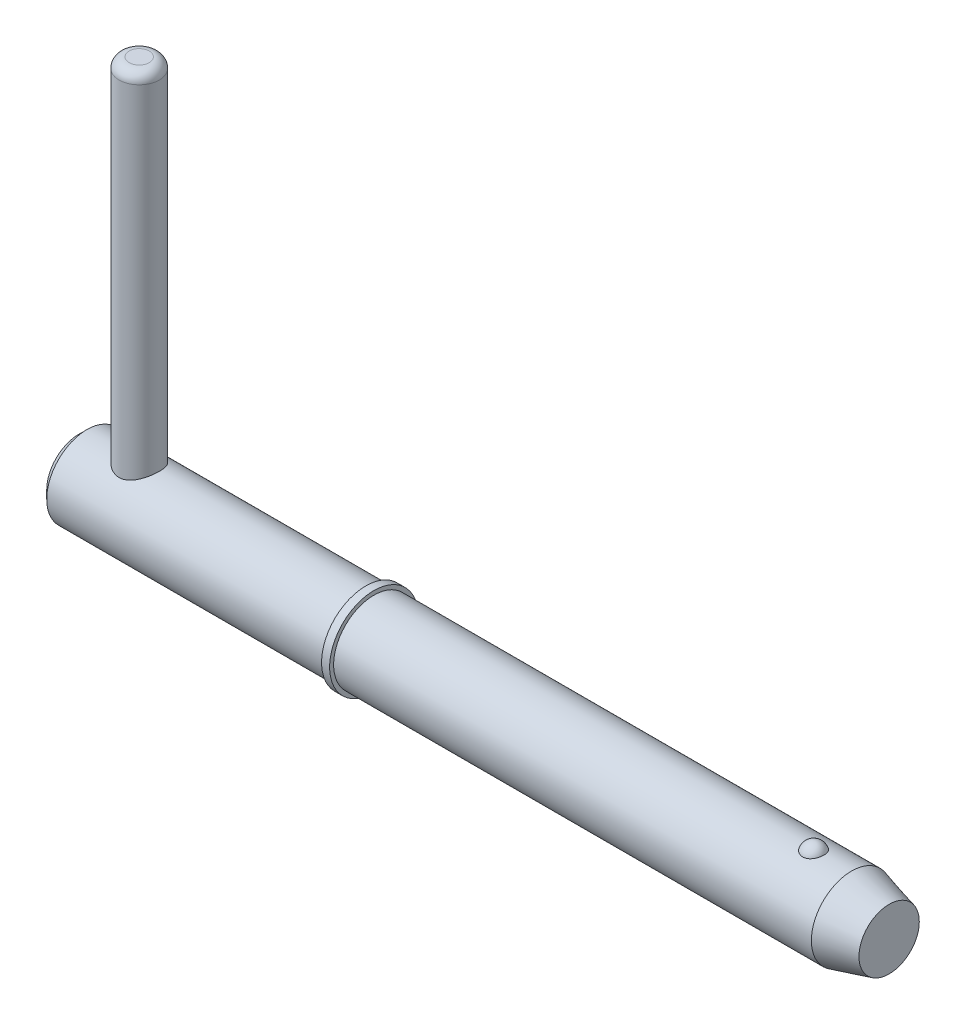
ISO-10303-21;
HEADER;
FILE_DESCRIPTION(('STEP AP214'),'2;1');
FILE_NAME('part.step','',(''),(''),'','','');
FILE_SCHEMA(('AUTOMOTIVE_DESIGN { 1 0 10303 214 1 1 1 1 }'));
ENDSEC;
DATA;
#1=APPLICATION_CONTEXT('core data for automotive mechanical design processes');
#2=APPLICATION_PROTOCOL_DEFINITION('international standard','automotive_design',2000,#1);
#3=PRODUCT_CONTEXT('',#1,'mechanical');
#4=PRODUCT('Part','Part','',(#3));
#5=PRODUCT_RELATED_PRODUCT_CATEGORY('part','',(#4));
#6=PRODUCT_DEFINITION_FORMATION('','',#4);
#7=PRODUCT_DEFINITION_CONTEXT('part definition',#1,'design');
#8=PRODUCT_DEFINITION('design','',#6,#7);
#9=PRODUCT_DEFINITION_SHAPE('','',#8);
#10=(LENGTH_UNIT() NAMED_UNIT(*) SI_UNIT(.MILLI.,.METRE.));
#11=(NAMED_UNIT(*) PLANE_ANGLE_UNIT() SI_UNIT($,.RADIAN.));
#12=(NAMED_UNIT(*) SI_UNIT($,.STERADIAN.) SOLID_ANGLE_UNIT());
#13=UNCERTAINTY_MEASURE_WITH_UNIT(LENGTH_MEASURE(1.E-05),#10,'distance_accuracy_value','');
#14=(GEOMETRIC_REPRESENTATION_CONTEXT(3) GLOBAL_UNCERTAINTY_ASSIGNED_CONTEXT((#13)) GLOBAL_UNIT_ASSIGNED_CONTEXT((#10,
#11,#12)) REPRESENTATION_CONTEXT('',''));
#15=CARTESIAN_POINT('',(0.,0.,0.));
#16=DIRECTION('',(0.,0.,1.));
#17=DIRECTION('',(1.,0.,0.));
#18=AXIS2_PLACEMENT_3D('',#15,#16,#17);
#19=CARTESIAN_POINT('',(3.57,23.02,0.));
#20=DIRECTION('',(0.,-1.,0.));
#21=DIRECTION('',(0.,0.,-1.));
#22=AXIS2_PLACEMENT_3D('',#19,#20,#21);
#23=CYLINDRICAL_SURFACE('',#22,1.19);
#24=CARTESIAN_POINT('',(3.57,-1.785,0.));
#25=DIRECTION('',(0.,1.,0.));
#26=DIRECTION('',(0.,0.,1.));
#27=AXIS2_PLACEMENT_3D('',#24,#25,#26);
#28=CIRCLE('',#27,1.19);
#29=CARTESIAN_POINT('',(3.57,-1.785,1.19));
#30=VERTEX_POINT('',#29);
#31=EDGE_CURVE('P0_E25',#30,#30,#28,.T.);
#32=ORIENTED_EDGE('',*,*,#31,.T.);
#33=EDGE_LOOP('',(#32));
#34=FACE_BOUND('',#33,.T.);
#35=CARTESIAN_POINT('',(3.57,22.425,0.));
#36=DIRECTION('',(0.,1.,0.));
#37=DIRECTION('',(0.,0.,1.));
#38=AXIS2_PLACEMENT_3D('',#35,#36,#37);
#39=CIRCLE('',#38,1.19);
#40=CARTESIAN_POINT('',(3.57,22.425,1.19));
#41=VERTEX_POINT('',#40);
#42=EDGE_CURVE('P0_E29',#41,#41,#39,.F.);
#43=ORIENTED_EDGE('',*,*,#42,.T.);
#44=EDGE_LOOP('',(#43));
#45=FACE_BOUND('',#44,.T.);
#46=ADVANCED_FACE('P0_F14',(#34,#45),#23,.T.);
#47=CARTESIAN_POINT('',(3.57,23.02,0.));
#48=DIRECTION('',(0.,1.,0.));
#49=DIRECTION('',(0.,0.,1.));
#50=AXIS2_PLACEMENT_3D('',#47,#48,#49);
#51=PLANE('',#50);
#52=CARTESIAN_POINT('',(3.57,23.02,0.));
#53=DIRECTION('',(0.,1.,0.));
#54=DIRECTION('',(0.,0.,1.));
#55=AXIS2_PLACEMENT_3D('',#52,#53,#54);
#56=CIRCLE('',#55,0.595);
#57=CARTESIAN_POINT('',(3.57,23.02,0.595));
#58=VERTEX_POINT('',#57);
#59=EDGE_CURVE('P0_E10',#58,#58,#56,.T.);
#60=ORIENTED_EDGE('',*,*,#59,.T.);
#61=EDGE_LOOP('',(#60));
#62=FACE_BOUND('',#61,.T.);
#63=ADVANCED_FACE('P0_F46',(#62),#51,.T.);
#64=CARTESIAN_POINT('',(3.57,-2.38,0.));
#65=DIRECTION('',(0.,1.,0.));
#66=DIRECTION('',(0.,0.,1.));
#67=AXIS2_PLACEMENT_3D('',#64,#65,#66);
#68=PLANE('',#67);
#69=CARTESIAN_POINT('',(3.57,-2.38,0.));
#70=DIRECTION('',(0.,1.,0.));
#71=DIRECTION('',(0.,0.,1.));
#72=AXIS2_PLACEMENT_3D('',#69,#70,#71);
#73=CIRCLE('',#72,0.595);
#74=CARTESIAN_POINT('',(3.57,-2.38,0.595));
#75=VERTEX_POINT('',#74);
#76=EDGE_CURVE('P0_E21',#75,#75,#73,.F.);
#77=ORIENTED_EDGE('',*,*,#76,.T.);
#78=EDGE_LOOP('',(#77));
#79=FACE_BOUND('',#78,.T.);
#80=ADVANCED_FACE('P0_F43',(#79),#68,.F.);
#81=CARTESIAN_POINT('',(3.57,-1.785,0.));
#82=DIRECTION('',(0.,1.,0.));
#83=DIRECTION('',(0.,0.,1.));
#84=AXIS2_PLACEMENT_3D('',#81,#82,#83);
#85=DEGENERATE_TOROIDAL_SURFACE('',#84,0.595,0.595,.T.);
#86=ORIENTED_EDGE('',*,*,#76,.F.);
#87=EDGE_LOOP('',(#86));
#88=FACE_BOUND('',#87,.T.);
#89=ORIENTED_EDGE('',*,*,#31,.F.);
#90=EDGE_LOOP('',(#89));
#91=FACE_BOUND('',#90,.T.);
#92=ADVANCED_FACE('P0_F38',(#88,#91),#85,.T.);
#93=CARTESIAN_POINT('',(3.57,22.425,0.));
#94=DIRECTION('',(0.,1.,0.));
#95=DIRECTION('',(0.,0.,1.));
#96=AXIS2_PLACEMENT_3D('',#93,#94,#95);
#97=DEGENERATE_TOROIDAL_SURFACE('',#96,0.595,0.595,.T.);
#98=ORIENTED_EDGE('',*,*,#42,.F.);
#99=EDGE_LOOP('',(#98));
#100=FACE_BOUND('',#99,.T.);
#101=ORIENTED_EDGE('',*,*,#59,.F.);
#102=EDGE_LOOP('',(#101));
#103=FACE_BOUND('',#102,.T.);
#104=ADVANCED_FACE('P0_F16',(#100,#103),#97,.T.);
#105=CLOSED_SHELL('',(#46,#63,#80,#92,#104));
#106=MANIFOLD_SOLID_BREP('P0_B1',#105);
#107=CARTESIAN_POINT('',(0.,0.,0.));
#108=DIRECTION('',(1.,0.,0.));
#109=DIRECTION('',(0.,0.,-1.));
#110=AXIS2_PLACEMENT_3D('',#107,#108,#109);
#111=CYLINDRICAL_SURFACE('',#110,2.38);
#112=CARTESIAN_POINT('',(45.7094297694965,0.,0.));
#113=DIRECTION('',(1.,0.,0.));
#114=DIRECTION('',(0.,0.,-1.));
#115=AXIS2_PLACEMENT_3D('',#112,#113,#114);
#116=CIRCLE('',#115,2.38);
#117=CARTESIAN_POINT('',(45.7094297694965,0.,-2.38));
#118=VERTEX_POINT('',#117);
#119=EDGE_CURVE('P1_E81',#118,#118,#116,.T.);
#120=ORIENTED_EDGE('',*,*,#119,.F.);
#121=EDGE_LOOP('',(#120));
#122=FACE_BOUND('',#121,.T.);
#123=CARTESIAN_POINT('',(17.45,0.,0.));
#124=DIRECTION('',(1.,0.,0.));
#125=DIRECTION('',(0.,0.,-1.));
#126=AXIS2_PLACEMENT_3D('',#123,#124,#125);
#127=CIRCLE('',#126,2.38);
#128=CARTESIAN_POINT('',(17.45,0.,-2.38));
#129=VERTEX_POINT('',#128);
#130=EDGE_CURVE('P1_E85',#129,#129,#127,.T.);
#131=ORIENTED_EDGE('',*,*,#130,.T.);
#132=EDGE_LOOP('',(#131));
#133=FACE_BOUND('',#132,.T.);
#134=CARTESIAN_POINT('',(43.4634492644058,2.2921568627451,0.640637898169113));
#135=CARTESIAN_POINT('',(43.4303559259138,2.29215737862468,0.640637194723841));
#136=CARTESIAN_POINT('',(43.3972546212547,2.29293179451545,0.637884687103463));
#137=CARTESIAN_POINT('',(43.3320176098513,2.29594030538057,0.626968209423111));
#138=CARTESIAN_POINT('',(43.2998823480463,2.29817506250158,0.61880178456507));
#139=CARTESIAN_POINT('',(43.2375402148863,2.3038430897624,0.597351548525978));
#140=CARTESIAN_POINT('',(43.2073305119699,2.30727454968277,0.584075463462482));
#141=CARTESIAN_POINT('',(43.1495674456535,2.31495941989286,0.552829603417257));
#142=CARTESIAN_POINT('',(43.1220141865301,2.31921286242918,0.534859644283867));
#143=CARTESIAN_POINT('',(43.0695938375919,2.32820213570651,0.494282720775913));
#144=CARTESIAN_POINT('',(43.0448050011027,2.33294694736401,0.471576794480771));
#145=CARTESIAN_POINT('',(42.9992169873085,2.34234144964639,0.422446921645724));
#146=CARTESIAN_POINT('',(42.9784185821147,2.34699112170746,0.396022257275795));
#147=CARTESIAN_POINT('',(42.9403580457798,2.35593942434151,0.338855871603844));
#148=CARTESIAN_POINT('',(42.9233051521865,2.36021170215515,0.307970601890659));
#149=CARTESIAN_POINT('',(42.8943607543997,2.3677057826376,0.243750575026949));
#150=CARTESIAN_POINT('',(42.8824701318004,2.37092740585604,0.210415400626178));
#151=CARTESIAN_POINT('',(42.8638076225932,2.37606901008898,0.1411894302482));
#152=CARTESIAN_POINT('',(42.8571956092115,2.37794816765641,0.10525240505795));
#153=CARTESIAN_POINT('',(42.8498095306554,2.38005135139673,0.032735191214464));
#154=CARTESIAN_POINT('',(42.8490358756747,2.38027526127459,-0.0038450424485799));
#155=CARTESIAN_POINT('',(42.8533628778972,2.37903842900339,-0.0769838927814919));
#156=CARTESIAN_POINT('',(42.8585202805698,2.37756141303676,-0.1135388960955));
#157=CARTESIAN_POINT('',(42.8747013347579,2.37305303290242,-0.185229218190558));
#158=CARTESIAN_POINT('',(42.8857251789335,2.37002161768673,-0.220364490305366));
#159=CARTESIAN_POINT('',(42.9133977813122,2.36273722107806,-0.28815667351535));
#160=CARTESIAN_POINT('',(42.9300389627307,2.35848588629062,-0.320816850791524));
#161=CARTESIAN_POINT('',(42.9685984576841,2.34923130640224,-0.382744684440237));
#162=CARTESIAN_POINT('',(42.990516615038,2.34422808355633,-0.412012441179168));
#163=CARTESIAN_POINT('',(43.0387549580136,2.33412555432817,-0.465830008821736));
#164=CARTESIAN_POINT('',(43.065002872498,2.32902887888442,-0.490444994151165));
#165=CARTESIAN_POINT('',(43.1214769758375,2.31926941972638,-0.534700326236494));
#166=CARTESIAN_POINT('',(43.151702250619,2.3146065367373,-0.554341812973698));
#167=CARTESIAN_POINT('',(43.2140618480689,2.30645675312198,-0.587312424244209));
#168=CARTESIAN_POINT('',(43.2460780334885,2.30293152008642,-0.600855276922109));
#169=CARTESIAN_POINT('',(43.3120795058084,2.29725171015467,-0.622220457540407));
#170=CARTESIAN_POINT('',(43.3460641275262,2.29509667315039,-0.630044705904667));
#171=CARTESIAN_POINT('',(43.413299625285,2.29249264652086,-0.639452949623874));
#172=CARTESIAN_POINT('',(43.4465087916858,2.29196755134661,-0.641315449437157));
#173=CARTESIAN_POINT('',(43.512763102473,2.29246849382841,-0.639522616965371));
#174=CARTESIAN_POINT('',(43.5458082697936,2.29349430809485,-0.635868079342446));
#175=CARTESIAN_POINT('',(43.6101025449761,2.29694059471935,-0.623301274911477));
#176=CARTESIAN_POINT('',(43.6413744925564,2.29933234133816,-0.614497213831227));
#177=CARTESIAN_POINT('',(43.7019952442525,2.30522511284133,-0.592006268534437));
#178=CARTESIAN_POINT('',(43.7313438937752,2.30872622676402,-0.578318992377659));
#179=CARTESIAN_POINT('',(43.7880369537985,2.31655795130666,-0.546112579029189));
#180=CARTESIAN_POINT('',(43.815320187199,2.32090569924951,-0.527490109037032));
#181=CARTESIAN_POINT('',(43.8664904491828,2.3299220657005,-0.486117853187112));
#182=CARTESIAN_POINT('',(43.8903767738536,2.33459075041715,-0.46336721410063));
#183=CARTESIAN_POINT('',(43.9352722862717,2.34399834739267,-0.413220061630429));
#184=CARTESIAN_POINT('',(43.9560972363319,2.34873051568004,-0.385657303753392));
#185=CARTESIAN_POINT('',(43.993056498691,2.35754932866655,-0.327455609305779));
#186=CARTESIAN_POINT('',(44.0091898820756,2.36163584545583,-0.296816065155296));
#187=CARTESIAN_POINT('',(44.0369822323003,2.36889321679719,-0.232047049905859));
#188=CARTESIAN_POINT('',(44.0484450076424,2.37202275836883,-0.197828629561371));
#189=CARTESIAN_POINT('',(44.0657523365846,2.37681926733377,-0.127900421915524));
#190=CARTESIAN_POINT('',(44.0715962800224,2.37848607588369,-0.0921904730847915));
#191=CARTESIAN_POINT('',(44.077605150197,2.38020024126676,-0.0196348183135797));
#192=CARTESIAN_POINT('',(44.0776704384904,2.38021918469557,0.0172198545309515));
#193=CARTESIAN_POINT('',(44.0718689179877,2.37856356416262,0.0904219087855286));
#194=CARTESIAN_POINT('',(44.0660018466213,2.37688892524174,0.126769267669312));
#195=CARTESIAN_POINT('',(44.048425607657,2.37201688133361,0.19802859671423));
#196=CARTESIAN_POINT('',(44.0366998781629,2.36881516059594,0.232936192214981));
#197=CARTESIAN_POINT('',(44.0076354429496,2.36123444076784,0.300196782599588));
#198=CARTESIAN_POINT('',(43.9902967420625,2.3568554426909,0.332549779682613));
#199=CARTESIAN_POINT('',(43.9505350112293,2.34744667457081,0.39349541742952));
#200=CARTESIAN_POINT('',(43.9281528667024,2.34242227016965,0.422115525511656));
#201=CARTESIAN_POINT('',(43.8787391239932,2.33227293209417,0.475004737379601));
#202=CARTESIAN_POINT('',(43.8517076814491,2.32714800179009,0.499273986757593));
#203=CARTESIAN_POINT('',(43.7944988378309,2.31755359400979,0.542046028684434));
#204=CARTESIAN_POINT('',(43.7644297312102,2.3130698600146,0.560690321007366));
#205=CARTESIAN_POINT('',(43.7013869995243,2.30514125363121,0.592447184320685));
#206=CARTESIAN_POINT('',(43.6684158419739,2.30169550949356,0.605564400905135));
#207=CARTESIAN_POINT('',(43.6068424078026,2.29677744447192,0.623927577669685));
#208=CARTESIAN_POINT('',(43.5785555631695,2.295058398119,0.630178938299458));
#209=CARTESIAN_POINT('',(43.5213308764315,2.29274795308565,0.638534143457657));
#210=CARTESIAN_POINT('',(43.4923931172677,2.29215641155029,0.640638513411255));
#211=CARTESIAN_POINT('',(43.4634492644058,2.2921568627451,0.640637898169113));
#212=B_SPLINE_CURVE_WITH_KNOTS('',3,(#134,#135,#136,#137,#138,#139,#140,#141,#142,#143,#144,
#145,#146,#147,#148,#149,#150,#151,#152,#153,#154,#155,#156,#157,#158,#159,#160,#161,#162,#163,
#164,#165,#166,#167,#168,#169,#170,#171,#172,#173,#174,#175,#176,#177,#178,#179,#180,#181,#182,
#183,#184,#185,#186,#187,#188,#189,#190,#191,#192,#193,#194,#195,#196,#197,#198,#199,#200,#201,
#202,#203,#204,#205,#206,#207,#208,#209,#210,#211),.UNSPECIFIED.,.T.,.F.,(4,2,2,2,2,2,2,2,2,2,2,
2,2,2,2,2,2,2,2,2,2,2,2,2,2,2,2,2,2,2,2,2,2,2,2,2,2,2,4),(0.,0.0991724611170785,
0.198389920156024,0.29745794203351,0.396529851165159,0.497927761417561,0.599345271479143,
0.705475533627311,0.811623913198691,0.920876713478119,1.03013718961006,1.14045177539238,
1.25076998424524,1.36093998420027,1.47110672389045,1.57959248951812,1.68805336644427,
1.79234266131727,1.89659691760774,1.99590391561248,2.09519661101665,2.19247425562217,
2.28975970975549,2.38926978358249,2.48880044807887,2.59293588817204,2.69709193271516,
2.80525821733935,2.91343624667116,3.02347917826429,3.13352698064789,3.24388765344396,
3.35424823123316,3.46374443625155,3.5732369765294,3.67968690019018,3.78604717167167,
3.87279565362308,3.9595331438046),.UNSPECIFIED.);
#213=CARTESIAN_POINT('',(43.4634492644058,2.2921568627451,0.640637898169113));
#214=VERTEX_POINT('',#213);
#215=EDGE_CURVE('P1_E35',#214,#214,#212,.T.);
#216=ORIENTED_EDGE('',*,*,#215,.T.);
#217=EDGE_LOOP('',(#216));
#218=FACE_BOUND('',#217,.T.);
#219=ADVANCED_FACE('P1_F13',(#122,#133,#218),#111,.T.);
#220=CARTESIAN_POINT('',(0.,0.,0.));
#221=DIRECTION('',(-1.,0.,0.));
#222=DIRECTION('',(0.,0.,1.));
#223=AXIS2_PLACEMENT_3D('',#220,#221,#222);
#224=PLANE('',#223);
#225=CARTESIAN_POINT('',(0.,0.,0.));
#226=DIRECTION('',(1.,0.,0.));
#227=DIRECTION('',(0.,0.,-1.));
#228=AXIS2_PLACEMENT_3D('',#225,#226,#227);
#229=CIRCLE('',#228,1.904);
#230=CARTESIAN_POINT('',(0.,0.,-1.904));
#231=VERTEX_POINT('',#230);
#232=EDGE_CURVE('P1_E9',#231,#231,#229,.T.);
#233=ORIENTED_EDGE('',*,*,#232,.F.);
#234=EDGE_LOOP('',(#233));
#235=FACE_BOUND('',#234,.T.);
#236=ADVANCED_FACE('P1_F15',(#235),#224,.T.);
#237=CARTESIAN_POINT('',(0.475999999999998,0.,0.));
#238=DIRECTION('',(1.,0.,0.));
#239=DIRECTION('',(0.,0.,-1.));
#240=AXIS2_PLACEMENT_3D('',#237,#238,#239);
#241=CONICAL_SURFACE('',#240,2.38,0.78539816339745);
#242=ORIENTED_EDGE('',*,*,#232,.T.);
#243=EDGE_LOOP('',(#242));
#244=FACE_BOUND('',#243,.T.);
#245=CARTESIAN_POINT('',(0.475999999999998,0.,0.));
#246=DIRECTION('',(1.,0.,0.));
#247=DIRECTION('',(0.,0.,-1.));
#248=AXIS2_PLACEMENT_3D('',#245,#246,#247);
#249=CIRCLE('',#248,2.38);
#250=CARTESIAN_POINT('',(0.475999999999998,0.,-2.38));
#251=VERTEX_POINT('',#250);
#252=EDGE_CURVE('P1_E26',#251,#251,#249,.T.);
#253=ORIENTED_EDGE('',*,*,#252,.F.);
#254=EDGE_LOOP('',(#253));
#255=FACE_BOUND('',#254,.T.);
#256=ADVANCED_FACE('P1_F77',(#244,#255),#241,.T.);
#257=CARTESIAN_POINT('',(0.,0.,0.));
#258=DIRECTION('',(1.,0.,0.));
#259=DIRECTION('',(0.,0.,-1.));
#260=AXIS2_PLACEMENT_3D('',#257,#258,#259);
#261=CYLINDRICAL_SURFACE('',#260,2.38);
#262=CARTESIAN_POINT('',(3.57,-2.06114046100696,1.19));
#263=CARTESIAN_POINT('',(3.50799170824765,-2.06114586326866,1.18999567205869));
#264=CARTESIAN_POINT('',(3.4459051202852,-2.0639812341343,1.18512096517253));
#265=CARTESIAN_POINT('',(3.32363755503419,-2.07491216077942,1.16587061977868));
#266=CARTESIAN_POINT('',(3.26346086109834,-2.08301876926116,1.15147501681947));
#267=CARTESIAN_POINT('',(3.14701251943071,-2.10331722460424,1.11395893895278));
#268=CARTESIAN_POINT('',(3.09072196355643,-2.1154873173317,1.09088484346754));
#269=CARTESIAN_POINT('',(2.9828251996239,-2.14250771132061,1.03680835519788));
#270=CARTESIAN_POINT('',(2.93121924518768,-2.15735815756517,1.00580553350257));
#271=CARTESIAN_POINT('',(2.82945618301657,-2.18956274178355,0.933753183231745));
#272=CARTESIAN_POINT('',(2.77976962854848,-2.20702235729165,0.892085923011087));
#273=CARTESIAN_POINT('',(2.68772401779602,-2.2416265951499,0.801172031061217));
#274=CARTESIAN_POINT('',(2.64536861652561,-2.25877105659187,0.751921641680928));
#275=CARTESIAN_POINT('',(2.56639309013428,-2.29219557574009,0.64318258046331));
#276=CARTESIAN_POINT('',(2.53035201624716,-2.30833946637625,0.583227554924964));
#277=CARTESIAN_POINT('',(2.46908238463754,-2.3365739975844,0.45714686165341));
#278=CARTESIAN_POINT('',(2.44384700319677,-2.34866719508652,0.391025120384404));
#279=CARTESIAN_POINT('',(2.40676945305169,-2.36667748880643,0.259473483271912));
#280=CARTESIAN_POINT('',(2.39410206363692,-2.37297281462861,0.194329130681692));
#281=CARTESIAN_POINT('',(2.3798023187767,-2.3800902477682,0.0625590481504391));
#282=CARTESIAN_POINT('',(2.37816328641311,-2.38091566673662,-0.00406576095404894));
#283=CARTESIAN_POINT('',(2.38564854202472,-2.37717948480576,-0.130700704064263));
#284=CARTESIAN_POINT('',(2.39384923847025,-2.37308010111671,-0.190782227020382));
#285=CARTESIAN_POINT('',(2.41912820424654,-2.360653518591,-0.308583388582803));
#286=CARTESIAN_POINT('',(2.43620713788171,-2.35232600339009,-0.366302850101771));
#287=CARTESIAN_POINT('',(2.47886825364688,-2.33206184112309,-0.478748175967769));
#288=CARTESIAN_POINT('',(2.50456481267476,-2.32007685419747,-0.533421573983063));
#289=CARTESIAN_POINT('',(2.56357346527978,-2.29357798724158,-0.637812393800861));
#290=CARTESIAN_POINT('',(2.5968882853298,-2.27906320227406,-0.687528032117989));
#291=CARTESIAN_POINT('',(2.67380546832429,-2.24724829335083,-0.785606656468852));
#292=CARTESIAN_POINT('',(2.71808260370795,-2.22981457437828,-0.833397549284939));
#293=CARTESIAN_POINT('',(2.81386177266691,-2.19500665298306,-0.921184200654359));
#294=CARTESIAN_POINT('',(2.86536931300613,-2.17763250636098,-0.961173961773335));
#295=CARTESIAN_POINT('',(2.97815134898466,-2.14371545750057,-1.03471134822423));
#296=CARTESIAN_POINT('',(3.03983836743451,-2.12729540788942,-1.06768860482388));
#297=CARTESIAN_POINT('',(3.16889582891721,-2.09886785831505,-1.12254974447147));
#298=CARTESIAN_POINT('',(3.2362602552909,-2.0868557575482,-1.14444520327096));
#299=CARTESIAN_POINT('',(3.36914526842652,-2.06994116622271,-1.1747444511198));
#300=CARTESIAN_POINT('',(3.43438893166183,-2.06455070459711,-1.18407989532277));
#301=CARTESIAN_POINT('',(3.56571759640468,-2.06010324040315,-1.1918051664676));
#302=CARTESIAN_POINT('',(3.63180197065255,-2.06104176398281,-1.19020272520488));
#303=CARTESIAN_POINT('',(3.75522816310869,-2.06862860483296,-1.17695289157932));
#304=CARTESIAN_POINT('',(3.81273554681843,-2.07464109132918,-1.16642350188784));
#305=CARTESIAN_POINT('',(3.92505766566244,-2.09075885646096,-1.1372785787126));
#306=CARTESIAN_POINT('',(3.97987152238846,-2.1008654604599,-1.1186604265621));
#307=CARTESIAN_POINT('',(4.08813948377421,-2.12458104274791,-1.07296063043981));
#308=CARTESIAN_POINT('',(4.14141303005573,-2.13833055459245,-1.04552693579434));
#309=CARTESIAN_POINT('',(4.2429084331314,-2.16765782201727,-0.983281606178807));
#310=CARTESIAN_POINT('',(4.29112767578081,-2.18323651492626,-0.948466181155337));
#311=CARTESIAN_POINT('',(4.38750473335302,-2.2168271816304,-0.867316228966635));
#312=CARTESIAN_POINT('',(4.43488860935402,-2.23489833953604,-0.82008287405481));
#313=CARTESIAN_POINT('',(4.52130056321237,-2.26973739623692,-0.718051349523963));
#314=CARTESIAN_POINT('',(4.56032581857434,-2.28650485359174,-0.663250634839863));
#315=CARTESIAN_POINT('',(4.62978273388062,-2.31742220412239,-0.545657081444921));
#316=CARTESIAN_POINT('',(4.65996041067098,-2.33149133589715,-0.482691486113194));
#317=CARTESIAN_POINT('',(4.7089941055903,-2.35481192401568,-0.351671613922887));
#318=CARTESIAN_POINT('',(4.7278600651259,-2.36406760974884,-0.283621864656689));
#319=CARTESIAN_POINT('',(4.75210859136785,-2.3760433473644,-0.151105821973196));
#320=CARTESIAN_POINT('',(4.75856947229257,-2.37928514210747,-0.0868836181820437));
#321=CARTESIAN_POINT('',(4.76100348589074,-2.38050135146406,0.0417999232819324));
#322=CARTESIAN_POINT('',(4.75698028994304,-2.37847760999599,0.106261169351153));
#323=CARTESIAN_POINT('',(4.73927447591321,-2.36969422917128,0.229120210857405));
#324=CARTESIAN_POINT('',(4.72624582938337,-2.36325544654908,0.287637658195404));
#325=CARTESIAN_POINT('',(4.69178087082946,-2.34658591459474,0.401560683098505));
#326=CARTESIAN_POINT('',(4.67034335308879,-2.33635462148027,0.456965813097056));
#327=CARTESIAN_POINT('',(4.61871480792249,-2.31247857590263,0.565753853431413));
#328=CARTESIAN_POINT('',(4.58818860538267,-2.29870654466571,0.618948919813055));
#329=CARTESIAN_POINT('',(4.51967006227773,-2.26918878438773,0.719681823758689));
#330=CARTESIAN_POINT('',(4.48167429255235,-2.25344215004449,0.76721704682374));
#331=CARTESIAN_POINT('',(4.39491140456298,-2.21969046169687,0.860267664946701));
#332=CARTESIAN_POINT('',(4.34544863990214,-2.20161660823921,0.905111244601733));
#333=CARTESIAN_POINT('',(4.23943364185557,-2.16655060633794,0.986109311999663));
#334=CARTESIAN_POINT('',(4.18287520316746,-2.1495594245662,1.02225611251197));
#335=CARTESIAN_POINT('',(4.06190239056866,-2.1181953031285,1.08579298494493));
#336=CARTESIAN_POINT('',(3.9972962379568,-2.10392207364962,1.11287022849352));
#337=CARTESIAN_POINT('',(3.86353443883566,-2.08090726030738,1.15534566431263));
#338=CARTESIAN_POINT('',(3.7943948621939,-2.07214719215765,1.17078291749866));
#339=CARTESIAN_POINT('',(3.69875162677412,-2.06499834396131,1.18329673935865));
#340=CARTESIAN_POINT('',(3.67309220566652,-2.06355673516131,1.18580656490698));
#341=CARTESIAN_POINT('',(3.62162638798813,-2.06162663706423,1.18915915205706));
#342=CARTESIAN_POINT('',(3.59581998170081,-2.0611382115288,1.19000180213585));
#343=CARTESIAN_POINT('',(3.57,-2.06114046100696,1.19));
#344=B_SPLINE_CURVE_WITH_KNOTS('',3,(#262,#263,#264,#265,#266,#267,#268,#269,#270,#271,#272,
#273,#274,#275,#276,#277,#278,#279,#280,#281,#282,#283,#284,#285,#286,#287,#288,#289,#290,#291,
#292,#293,#294,#295,#296,#297,#298,#299,#300,#301,#302,#303,#304,#305,#306,#307,#308,#309,#310,
#311,#312,#313,#314,#315,#316,#317,#318,#319,#320,#321,#322,#323,#324,#325,#326,#327,#328,#329,
#330,#331,#332,#333,#334,#335,#336,#337,#338,#339,#340,#341,#342,#343),.UNSPECIFIED.,.T.,.F.,(4,
2,2,2,2,2,2,2,2,2,2,2,2,2,2,2,2,2,2,2,2,2,2,2,2,2,2,2,2,2,2,2,2,2,2,2,2,2,2,2,4),(0.,
0.185916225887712,0.372223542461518,0.557549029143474,0.742884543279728,0.943506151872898,
1.14422749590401,1.35847891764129,1.5725948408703,1.77147547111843,1.97023568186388,
2.15171156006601,2.33320101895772,2.51720146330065,2.70126786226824,2.902733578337,
3.10435357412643,3.31877721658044,3.53297641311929,3.73020126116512,3.92728670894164,
4.1028127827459,4.27839572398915,4.46211082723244,4.64592048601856,4.8529002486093,
5.0599497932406,5.27246375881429,5.48479067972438,5.67763601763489,5.87041383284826,
6.05048865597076,6.23058930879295,6.41839293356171,6.60628297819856,6.8128718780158,
7.01964271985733,7.2329479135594,7.44553408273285,7.52294360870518,7.60035831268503),.UNSPECIFIED.);
#345=CARTESIAN_POINT('',(3.57,-2.06114046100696,1.19));
#346=VERTEX_POINT('',#345);
#347=EDGE_CURVE('P1_E17',#346,#346,#344,.T.);
#348=ORIENTED_EDGE('',*,*,#347,.F.);
#349=EDGE_LOOP('',(#348));
#350=FACE_BOUND('',#349,.T.);
#351=CARTESIAN_POINT('',(3.57,2.06114046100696,1.19));
#352=CARTESIAN_POINT('',(3.63200829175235,2.06114586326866,1.18999567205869));
#353=CARTESIAN_POINT('',(3.6940948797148,2.0639812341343,1.18512096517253));
#354=CARTESIAN_POINT('',(3.81636244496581,2.07491216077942,1.16587061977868));
#355=CARTESIAN_POINT('',(3.87653913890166,2.08301876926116,1.15147501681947));
#356=CARTESIAN_POINT('',(3.99298748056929,2.10331722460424,1.11395893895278));
#357=CARTESIAN_POINT('',(4.04927803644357,2.1154873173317,1.09088484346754));
#358=CARTESIAN_POINT('',(4.1571748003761,2.14250771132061,1.03680835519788));
#359=CARTESIAN_POINT('',(4.20878075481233,2.15735815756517,1.00580553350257));
#360=CARTESIAN_POINT('',(4.31054381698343,2.18956274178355,0.933753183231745));
#361=CARTESIAN_POINT('',(4.36023037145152,2.20702235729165,0.892085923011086));
#362=CARTESIAN_POINT('',(4.45227598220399,2.2416265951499,0.801172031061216));
#363=CARTESIAN_POINT('',(4.49463138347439,2.25877105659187,0.751921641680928));
#364=CARTESIAN_POINT('',(4.57360690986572,2.29219557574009,0.643182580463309));
#365=CARTESIAN_POINT('',(4.60964798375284,2.30833946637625,0.583227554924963));
#366=CARTESIAN_POINT('',(4.67091761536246,2.3365739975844,0.457146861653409));
#367=CARTESIAN_POINT('',(4.69615299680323,2.34866719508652,0.391025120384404));
#368=CARTESIAN_POINT('',(4.73323054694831,2.36667748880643,0.259473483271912));
#369=CARTESIAN_POINT('',(4.74589793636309,2.37297281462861,0.194329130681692));
#370=CARTESIAN_POINT('',(4.7601976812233,2.3800902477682,0.0625590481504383));
#371=CARTESIAN_POINT('',(4.76183671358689,2.38091566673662,-0.00406576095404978));
#372=CARTESIAN_POINT('',(4.75435145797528,2.37717948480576,-0.130700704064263));
#373=CARTESIAN_POINT('',(4.74615076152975,2.37308010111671,-0.190782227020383));
#374=CARTESIAN_POINT('',(4.72087179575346,2.360653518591,-0.308583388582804));
#375=CARTESIAN_POINT('',(4.70379286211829,2.35232600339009,-0.366302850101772));
#376=CARTESIAN_POINT('',(4.66113174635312,2.33206184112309,-0.478748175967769));
#377=CARTESIAN_POINT('',(4.63543518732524,2.32007685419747,-0.533421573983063));
#378=CARTESIAN_POINT('',(4.57642653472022,2.29357798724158,-0.637812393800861));
#379=CARTESIAN_POINT('',(4.5431117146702,2.27906320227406,-0.687528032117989));
#380=CARTESIAN_POINT('',(4.46619453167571,2.24724829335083,-0.785606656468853));
#381=CARTESIAN_POINT('',(4.42191739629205,2.22981457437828,-0.83339754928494));
#382=CARTESIAN_POINT('',(4.32613822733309,2.19500665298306,-0.921184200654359));
#383=CARTESIAN_POINT('',(4.27463068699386,2.17763250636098,-0.961173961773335));
#384=CARTESIAN_POINT('',(4.16184865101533,2.14371545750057,-1.03471134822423));
#385=CARTESIAN_POINT('',(4.10016163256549,2.12729540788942,-1.06768860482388));
#386=CARTESIAN_POINT('',(3.97110417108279,2.09886785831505,-1.12254974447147));
#387=CARTESIAN_POINT('',(3.9037397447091,2.0868557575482,-1.14444520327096));
#388=CARTESIAN_POINT('',(3.77085473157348,2.06994116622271,-1.1747444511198));
#389=CARTESIAN_POINT('',(3.70561106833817,2.06455070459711,-1.18407989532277));
#390=CARTESIAN_POINT('',(3.57428240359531,2.06010324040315,-1.1918051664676));
#391=CARTESIAN_POINT('',(3.50819802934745,2.06104176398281,-1.19020272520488));
#392=CARTESIAN_POINT('',(3.38477183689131,2.06862860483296,-1.17695289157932));
#393=CARTESIAN_POINT('',(3.32726445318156,2.07464109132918,-1.16642350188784));
#394=CARTESIAN_POINT('',(3.21494233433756,2.09075885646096,-1.1372785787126));
#395=CARTESIAN_POINT('',(3.16012847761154,2.1008654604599,-1.1186604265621));
#396=CARTESIAN_POINT('',(3.05186051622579,2.12458104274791,-1.07296063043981));
#397=CARTESIAN_POINT('',(2.99858696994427,2.13833055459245,-1.04552693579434));
#398=CARTESIAN_POINT('',(2.8970915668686,2.16765782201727,-0.983281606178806));
#399=CARTESIAN_POINT('',(2.84887232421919,2.18323651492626,-0.948466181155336));
#400=CARTESIAN_POINT('',(2.75249526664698,2.2168271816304,-0.867316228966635));
#401=CARTESIAN_POINT('',(2.70511139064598,2.23489833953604,-0.820082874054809));
#402=CARTESIAN_POINT('',(2.61869943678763,2.26973739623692,-0.718051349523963));
#403=CARTESIAN_POINT('',(2.57967418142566,2.28650485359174,-0.663250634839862));
#404=CARTESIAN_POINT('',(2.51021726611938,2.31742220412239,-0.54565708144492));
#405=CARTESIAN_POINT('',(2.48003958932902,2.33149133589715,-0.482691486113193));
#406=CARTESIAN_POINT('',(2.4310058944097,2.35481192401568,-0.351671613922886));
#407=CARTESIAN_POINT('',(2.4121399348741,2.36406760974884,-0.283621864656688));
#408=CARTESIAN_POINT('',(2.38789140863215,2.3760433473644,-0.151105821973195));
#409=CARTESIAN_POINT('',(2.38143052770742,2.37928514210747,-0.0868836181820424));
#410=CARTESIAN_POINT('',(2.37899651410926,2.38050135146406,0.0417999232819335));
#411=CARTESIAN_POINT('',(2.38301971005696,2.37847760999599,0.106261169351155));
#412=CARTESIAN_POINT('',(2.40072552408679,2.36969422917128,0.229120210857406));
#413=CARTESIAN_POINT('',(2.41375417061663,2.36325544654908,0.287637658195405));
#414=CARTESIAN_POINT('',(2.44821912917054,2.34658591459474,0.401560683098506));
#415=CARTESIAN_POINT('',(2.46965664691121,2.33635462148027,0.456965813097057));
#416=CARTESIAN_POINT('',(2.52128519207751,2.31247857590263,0.565753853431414));
#417=CARTESIAN_POINT('',(2.55181139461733,2.29870654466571,0.618948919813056));
#418=CARTESIAN_POINT('',(2.62032993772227,2.26918878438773,0.719681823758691));
#419=CARTESIAN_POINT('',(2.65832570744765,2.25344215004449,0.767217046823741));
#420=CARTESIAN_POINT('',(2.74508859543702,2.21969046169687,0.860267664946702));
#421=CARTESIAN_POINT('',(2.79455136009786,2.20161660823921,0.905111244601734));
#422=CARTESIAN_POINT('',(2.90056635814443,2.16655060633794,0.986109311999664));
#423=CARTESIAN_POINT('',(2.95712479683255,2.1495594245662,1.02225611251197));
#424=CARTESIAN_POINT('',(3.07809760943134,2.1181953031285,1.08579298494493));
#425=CARTESIAN_POINT('',(3.1427037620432,2.10392207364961,1.11287022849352));
#426=CARTESIAN_POINT('',(3.27646556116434,2.08090726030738,1.15534566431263));
#427=CARTESIAN_POINT('',(3.3456051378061,2.07214719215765,1.17078291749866));
#428=CARTESIAN_POINT('',(3.44124837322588,2.06499834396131,1.18329673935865));
#429=CARTESIAN_POINT('',(3.46690779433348,2.06355673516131,1.18580656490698));
#430=CARTESIAN_POINT('',(3.51837361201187,2.06162663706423,1.18915915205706));
#431=CARTESIAN_POINT('',(3.54418001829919,2.0611382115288,1.19000180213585));
#432=CARTESIAN_POINT('',(3.57,2.06114046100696,1.19));
#433=B_SPLINE_CURVE_WITH_KNOTS('',3,(#351,#352,#353,#354,#355,#356,#357,#358,#359,#360,#361,
#362,#363,#364,#365,#366,#367,#368,#369,#370,#371,#372,#373,#374,#375,#376,#377,#378,#379,#380,
#381,#382,#383,#384,#385,#386,#387,#388,#389,#390,#391,#392,#393,#394,#395,#396,#397,#398,#399,
#400,#401,#402,#403,#404,#405,#406,#407,#408,#409,#410,#411,#412,#413,#414,#415,#416,#417,#418,
#419,#420,#421,#422,#423,#424,#425,#426,#427,#428,#429,#430,#431,#432),.UNSPECIFIED.,.T.,.F.,(4,
2,2,2,2,2,2,2,2,2,2,2,2,2,2,2,2,2,2,2,2,2,2,2,2,2,2,2,2,2,2,2,2,2,2,2,2,2,2,2,4),(0.,
0.185916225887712,0.372223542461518,0.557549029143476,0.74288454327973,0.9435061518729,
1.14422749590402,1.35847891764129,1.5725948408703,1.77147547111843,1.97023568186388,
2.15171156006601,2.33320101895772,2.51720146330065,2.70126786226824,2.902733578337,
3.10435357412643,3.31877721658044,3.53297641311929,3.73020126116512,3.92728670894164,
4.1028127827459,4.27839572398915,4.46211082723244,4.64592048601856,4.8529002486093,
5.05994979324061,5.27246375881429,5.48479067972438,5.67763601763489,5.87041383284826,
6.05048865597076,6.23058930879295,6.41839293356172,6.60628297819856,6.8128718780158,
7.01964271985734,7.2329479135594,7.44553408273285,7.52294360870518,7.60035831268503),.UNSPECIFIED.);
#434=CARTESIAN_POINT('',(3.57,2.06114046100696,1.19));
#435=VERTEX_POINT('',#434);
#436=EDGE_CURVE('P1_E43',#435,#435,#433,.T.);
#437=ORIENTED_EDGE('',*,*,#436,.F.);
#438=EDGE_LOOP('',(#437));
#439=FACE_BOUND('',#438,.T.);
#440=ORIENTED_EDGE('',*,*,#252,.T.);
#441=EDGE_LOOP('',(#440));
#442=FACE_BOUND('',#441,.T.);
#443=CARTESIAN_POINT('',(16.974,0.,0.));
#444=DIRECTION('',(1.,0.,0.));
#445=DIRECTION('',(0.,0.,-1.));
#446=AXIS2_PLACEMENT_3D('',#443,#444,#445);
#447=CIRCLE('',#446,2.38);
#448=CARTESIAN_POINT('',(16.974,0.,-2.38));
#449=VERTEX_POINT('',#448);
#450=EDGE_CURVE('P1_E31',#449,#449,#447,.T.);
#451=ORIENTED_EDGE('',*,*,#450,.F.);
#452=EDGE_LOOP('',(#451));
#453=FACE_BOUND('',#452,.T.);
#454=ADVANCED_FACE('P1_F103',(#350,#439,#442,#453),#261,.T.);
#455=CARTESIAN_POINT('',(16.974,2.38,0.));
#456=DIRECTION('',(-1.,0.,0.));
#457=DIRECTION('',(0.,0.,1.));
#458=AXIS2_PLACEMENT_3D('',#455,#456,#457);
#459=PLANE('',#458);
#460=ORIENTED_EDGE('',*,*,#450,.T.);
#461=EDGE_LOOP('',(#460));
#462=FACE_BOUND('',#461,.T.);
#463=CARTESIAN_POINT('',(16.974,0.,0.));
#464=DIRECTION('',(1.,0.,0.));
#465=DIRECTION('',(0.,0.,-1.));
#466=AXIS2_PLACEMENT_3D('',#463,#464,#465);
#467=CIRCLE('',#466,2.618);
#468=CARTESIAN_POINT('',(16.974,0.,-2.618));
#469=VERTEX_POINT('',#468);
#470=EDGE_CURVE('P1_E91',#469,#469,#467,.T.);
#471=ORIENTED_EDGE('',*,*,#470,.F.);
#472=EDGE_LOOP('',(#471));
#473=FACE_BOUND('',#472,.T.);
#474=ADVANCED_FACE('P1_F100',(#462,#473),#459,.T.);
#475=CARTESIAN_POINT('',(0.,0.,0.));
#476=DIRECTION('',(1.,0.,0.));
#477=DIRECTION('',(0.,0.,-1.));
#478=AXIS2_PLACEMENT_3D('',#475,#476,#477);
#479=CYLINDRICAL_SURFACE('',#478,2.618);
#480=ORIENTED_EDGE('',*,*,#470,.T.);
#481=EDGE_LOOP('',(#480));
#482=FACE_BOUND('',#481,.T.);
#483=CARTESIAN_POINT('',(17.45,0.,0.));
#484=DIRECTION('',(1.,0.,0.));
#485=DIRECTION('',(0.,0.,-1.));
#486=AXIS2_PLACEMENT_3D('',#483,#484,#485);
#487=CIRCLE('',#486,2.618);
#488=CARTESIAN_POINT('',(17.45,0.,-2.618));
#489=VERTEX_POINT('',#488);
#490=EDGE_CURVE('P1_E88',#489,#489,#487,.T.);
#491=ORIENTED_EDGE('',*,*,#490,.F.);
#492=EDGE_LOOP('',(#491));
#493=FACE_BOUND('',#492,.T.);
#494=ADVANCED_FACE('P1_F68',(#482,#493),#479,.T.);
#495=CARTESIAN_POINT('',(17.45,2.618,0.));
#496=DIRECTION('',(1.,0.,0.));
#497=DIRECTION('',(0.,0.,-1.));
#498=AXIS2_PLACEMENT_3D('',#495,#496,#497);
#499=PLANE('',#498);
#500=ORIENTED_EDGE('',*,*,#490,.T.);
#501=EDGE_LOOP('',(#500));
#502=FACE_BOUND('',#501,.T.);
#503=ORIENTED_EDGE('',*,*,#130,.F.);
#504=EDGE_LOOP('',(#503));
#505=FACE_BOUND('',#504,.T.);
#506=ADVANCED_FACE('P1_F62',(#502,#505),#499,.T.);
#507=CARTESIAN_POINT('',(47.93,0.,0.));
#508=DIRECTION('',(-1.,0.,0.));
#509=DIRECTION('',(0.,0.,1.));
#510=AXIS2_PLACEMENT_3D('',#507,#508,#509);
#511=CONICAL_SURFACE('',#510,1.78500000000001,0.26179938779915);
#512=ORIENTED_EDGE('',*,*,#119,.T.);
#513=EDGE_LOOP('',(#512));
#514=FACE_BOUND('',#513,.T.);
#515=CARTESIAN_POINT('',(47.93,0.,0.));
#516=DIRECTION('',(1.,0.,0.));
#517=DIRECTION('',(0.,0.,-1.));
#518=AXIS2_PLACEMENT_3D('',#515,#516,#517);
#519=CIRCLE('',#518,1.78500000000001);
#520=CARTESIAN_POINT('',(47.93,0.,-1.78500000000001));
#521=VERTEX_POINT('',#520);
#522=EDGE_CURVE('P1_E42',#521,#521,#519,.T.);
#523=ORIENTED_EDGE('',*,*,#522,.F.);
#524=EDGE_LOOP('',(#523));
#525=FACE_BOUND('',#524,.T.);
#526=ADVANCED_FACE('P1_F59',(#514,#525),#511,.T.);
#527=CARTESIAN_POINT('',(47.93,1.78500000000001,0.));
#528=DIRECTION('',(1.,0.,0.));
#529=DIRECTION('',(0.,0.,-1.));
#530=AXIS2_PLACEMENT_3D('',#527,#528,#529);
#531=PLANE('',#530);
#532=ORIENTED_EDGE('',*,*,#522,.T.);
#533=EDGE_LOOP('',(#532));
#534=FACE_BOUND('',#533,.T.);
#535=ADVANCED_FACE('P1_F55',(#534),#531,.T.);
#536=CARTESIAN_POINT('',(43.4634492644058,2.142,0.));
#537=DIRECTION('',(-1.,0.,0.));
#538=DIRECTION('',(0.,1.,0.));
#539=AXIS2_PLACEMENT_3D('',#536,#537,#538);
#540=SPHERICAL_SURFACE('',#539,0.657999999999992);
#541=ORIENTED_EDGE('',*,*,#215,.F.);
#542=EDGE_LOOP('',(#541));
#543=FACE_BOUND('',#542,.T.);
#544=ADVANCED_FACE('P1_F50',(#543),#540,.T.);
#545=CARTESIAN_POINT('',(3.57,-2.618,0.));
#546=DIRECTION('',(0.,1.,0.));
#547=DIRECTION('',(0.,0.,1.));
#548=AXIS2_PLACEMENT_3D('',#545,#546,#547);
#549=CYLINDRICAL_SURFACE('',#548,1.19);
#550=ORIENTED_EDGE('',*,*,#347,.T.);
#551=EDGE_LOOP('',(#550));
#552=FACE_BOUND('',#551,.T.);
#553=ORIENTED_EDGE('',*,*,#436,.T.);
#554=EDGE_LOOP('',(#553));
#555=FACE_BOUND('',#554,.T.);
#556=ADVANCED_FACE('P1_F54',(#552,#555),#549,.F.);
#557=CLOSED_SHELL('',(#219,#236,#256,#454,#474,#494,#506,#526,#535,#544,#556));
#558=MANIFOLD_SOLID_BREP('P1_B1',#557);
#559=ADVANCED_BREP_SHAPE_REPRESENTATION('',(#18,#106,#558),#14);
#560=SHAPE_DEFINITION_REPRESENTATION(#9,#559);
ENDSEC;
END-ISO-10303-21;
